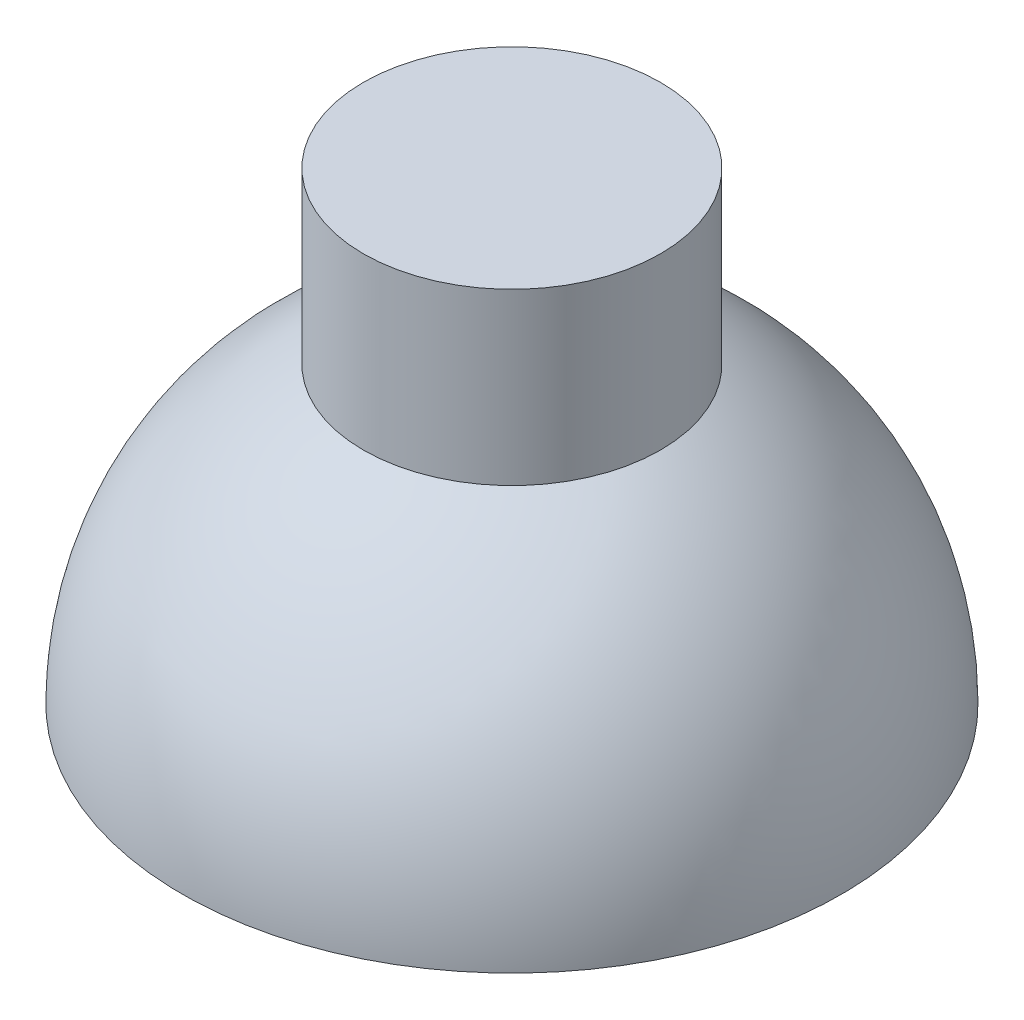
from build123d import *

# Parameters (mm, degrees)
ESQUISSE2_R      = 8
EXTRUSION1_DEPTH = 25


with BuildPart() as part:
    # Esquisse1 → R_volution2 (revolve)
    with BuildSketch(Plane.XY, mode=Mode.PRIVATE) as r_volution2_sk:
        with BuildLine():
            Line((0, 0), (17.75, 0))
            ThreePointArc((17.75, 0), (12.551145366, 12.551145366), (0, 17.75))
            Line((0, 17.75), (0, 0))
        make_face()
    revolve(r_volution2_sk.sketch.rotate(Axis((0, -74.741456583, 0), (0, 1, 0)), 90), axis=Axis((0, -74.741456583, 0), (0, 1, 0)))

    # Esquisse2 → Extrusion1 (add)
    with BuildSketch(Plane(origin=(0, 0, 0), x_dir=(1, 0, 0), z_dir=(0, 1, 0))):
        with Locations(Location((0, 0, 0), (0, 0, 90))):
            Circle(ESQUISSE2_R)
    extrude(amount=EXTRUSION1_DEPTH)


solid = part.part
